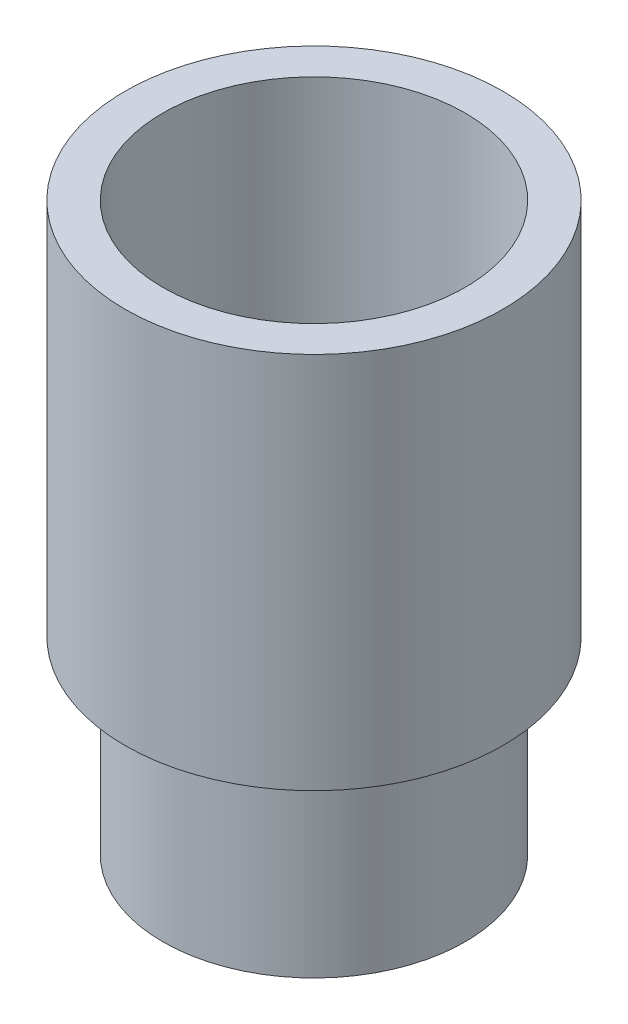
from build123d import *

# Parameters (mm, degrees)
SKETCH2_R                = 5
SKETCH2_R_2              = 4
BOSS_EXTRUDE1_DEPTH      = 10
BOSS_EXTRUDE2_DEPTH      = 5
BOSS_EXTRUDE2_DEPTH_BACK = 3
SKETCH3_R                = 4
SKETCH3_R_2              = 3


with BuildPart() as part:
    # Sketch2 → Boss-Extrude1 (new body)
    with BuildSketch(Plane(origin=(0, 0, 0), x_dir=(1, 0, 0), z_dir=(0, 1, 0))):
        with Locations(Location((0, 0, 0), (0, 0, 270))):
            Circle(SKETCH2_R)
        with Locations(Location((0, 0, 0), (0, 0, 270))):
            Circle(SKETCH2_R_2, mode=Mode.SUBTRACT)
    extrude(amount=BOSS_EXTRUDE1_DEPTH)


with BuildPart() as body_2:
    # Sketch3 → Boss-Extrude2 (new, two sides: drawn at the far end of the back side and taken through both)
    with BuildSketch(Plane.XZ.offset(-BOSS_EXTRUDE2_DEPTH_BACK)):
        with Locations(Location((0, 0, 0), (0, 0, 270))):
            Circle(SKETCH3_R)
        with Locations(Location((0, 0, 0), (0, 0, 270))):
            Circle(SKETCH3_R_2, mode=Mode.SUBTRACT)
    extrude(amount=BOSS_EXTRUDE2_DEPTH + BOSS_EXTRUDE2_DEPTH_BACK)


solid = Compound([part.part, body_2.part])
